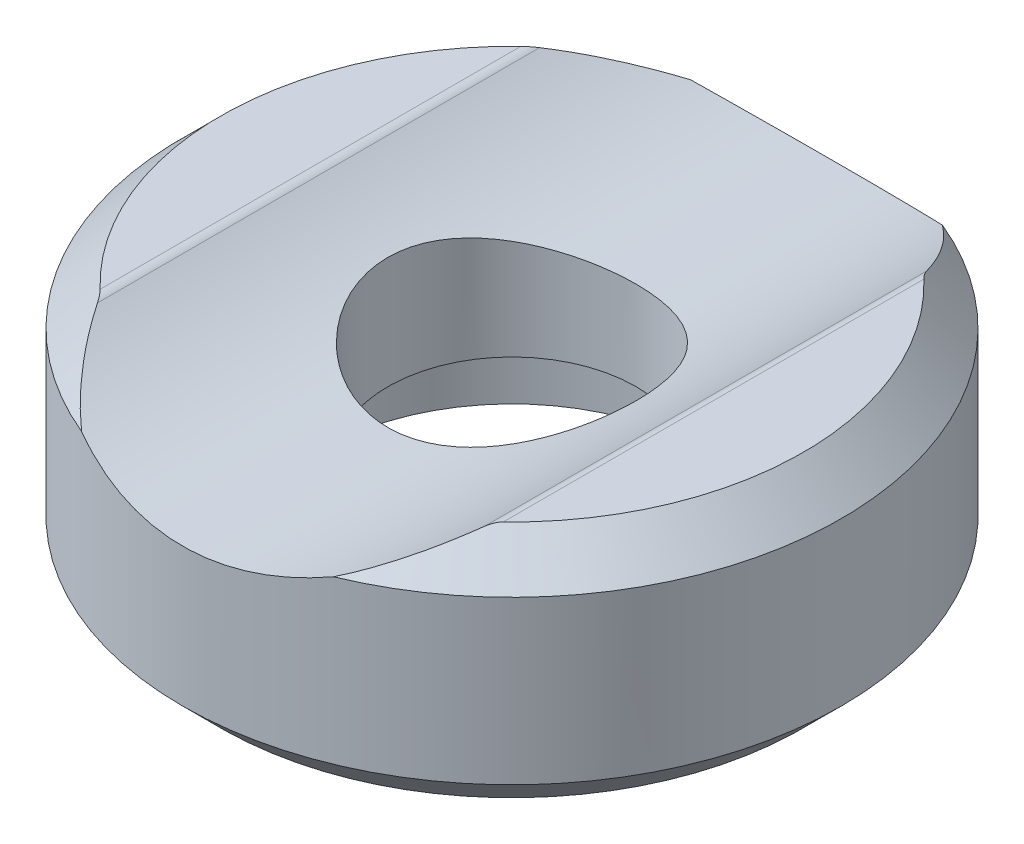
ISO-10303-21;
HEADER;
FILE_DESCRIPTION(('STEP AP214'),'2;1');
FILE_NAME('part.step','',(''),(''),'','','');
FILE_SCHEMA(('AUTOMOTIVE_DESIGN { 1 0 10303 214 1 1 1 1 }'));
ENDSEC;
DATA;
#1=APPLICATION_CONTEXT('core data for automotive mechanical design processes');
#2=APPLICATION_PROTOCOL_DEFINITION('international standard','automotive_design',2000,#1);
#3=PRODUCT_CONTEXT('',#1,'mechanical');
#4=PRODUCT('Part','Part','',(#3));
#5=PRODUCT_RELATED_PRODUCT_CATEGORY('part','',(#4));
#6=PRODUCT_DEFINITION_FORMATION('','',#4);
#7=PRODUCT_DEFINITION_CONTEXT('part definition',#1,'design');
#8=PRODUCT_DEFINITION('design','',#6,#7);
#9=PRODUCT_DEFINITION_SHAPE('','',#8);
#10=(LENGTH_UNIT() NAMED_UNIT(*) SI_UNIT(.MILLI.,.METRE.));
#11=(NAMED_UNIT(*) PLANE_ANGLE_UNIT() SI_UNIT($,.RADIAN.));
#12=(NAMED_UNIT(*) SI_UNIT($,.STERADIAN.) SOLID_ANGLE_UNIT());
#13=UNCERTAINTY_MEASURE_WITH_UNIT(LENGTH_MEASURE(1.E-05),#10,'distance_accuracy_value','');
#14=(GEOMETRIC_REPRESENTATION_CONTEXT(3) GLOBAL_UNCERTAINTY_ASSIGNED_CONTEXT((#13)) GLOBAL_UNIT_ASSIGNED_CONTEXT((#10,
#11,#12)) REPRESENTATION_CONTEXT('',''));
#15=CARTESIAN_POINT('',(0.,0.,0.));
#16=DIRECTION('',(0.,0.,1.));
#17=DIRECTION('',(1.,0.,0.));
#18=AXIS2_PLACEMENT_3D('',#15,#16,#17);
#19=CARTESIAN_POINT('',(0.,0.,0.));
#20=DIRECTION('',(0.,-1.,0.));
#21=DIRECTION('',(0.,0.,-1.));
#22=AXIS2_PLACEMENT_3D('',#19,#20,#21);
#23=CYLINDRICAL_SURFACE('',#22,2.6);
#24=CARTESIAN_POINT('',(-1.83991349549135,3.93905765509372,1.83704064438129));
#25=CARTESIAN_POINT('',(-1.94232335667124,3.96612524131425,1.73447148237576));
#26=CARTESIAN_POINT('',(-2.03611916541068,3.99334161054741,1.62335929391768));
#27=CARTESIAN_POINT('',(-2.20413507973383,4.04510891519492,1.38666461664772));
#28=CARTESIAN_POINT('',(-2.2783605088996,4.06966057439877,1.26108607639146));
#29=CARTESIAN_POINT('',(-2.40521973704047,4.11328848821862,0.998134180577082));
#30=CARTESIAN_POINT('',(-2.45779905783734,4.1323508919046,0.860732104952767));
#31=CARTESIAN_POINT('',(-2.53914294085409,4.16244379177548,0.578215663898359));
#32=CARTESIAN_POINT('',(-2.56791760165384,4.1734776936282,0.433104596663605));
#33=CARTESIAN_POINT('',(-2.59971405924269,4.1857044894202,0.146227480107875));
#34=CARTESIAN_POINT('',(-2.60382389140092,4.18731308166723,0.00459952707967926));
#35=CARTESIAN_POINT('',(-2.58902319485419,4.18159094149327,-0.277251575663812));
#36=CARTESIAN_POINT('',(-2.57011488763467,4.17426107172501,-0.417474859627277));
#37=CARTESIAN_POINT('',(-2.51099174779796,4.15197338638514,-0.688134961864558));
#38=CARTESIAN_POINT('',(-2.47144832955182,4.13725647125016,-0.818740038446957));
#39=CARTESIAN_POINT('',(-2.3728231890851,4.10202697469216,-1.07150689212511));
#40=CARTESIAN_POINT('',(-2.31373706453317,4.08151308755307,-1.19366675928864));
#41=CARTESIAN_POINT('',(-2.17455428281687,4.03582452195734,-1.43221967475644));
#42=CARTESIAN_POINT('',(-2.0936152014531,4.01047868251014,-1.54808790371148));
#43=CARTESIAN_POINT('',(-1.91424028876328,3.95850203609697,-1.76508193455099));
#44=CARTESIAN_POINT('',(-1.8157985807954,3.93187079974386,-1.86620276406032));
#45=CARTESIAN_POINT('',(-1.59812685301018,3.87866377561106,-2.05619005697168));
#46=CARTESIAN_POINT('',(-1.47808355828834,3.85216247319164,-2.14414916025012));
#47=CARTESIAN_POINT('',(-1.22408077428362,3.80364055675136,-2.29863239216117));
#48=CARTESIAN_POINT('',(-1.09012300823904,3.78161938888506,-2.36515917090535));
#49=CARTESIAN_POINT('',(-0.81433205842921,3.74487167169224,-2.47354498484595));
#50=CARTESIAN_POINT('',(-0.672676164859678,3.73002501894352,-2.51581256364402));
#51=CARTESIAN_POINT('',(-0.383657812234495,3.70877173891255,-2.57576465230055));
#52=CARTESIAN_POINT('',(-0.236297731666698,3.70236163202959,-2.59345929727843));
#53=CARTESIAN_POINT('',(0.0513025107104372,3.6988245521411,-2.60325510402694));
#54=CARTESIAN_POINT('',(0.19149263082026,3.70121032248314,-2.59669956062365));
#55=CARTESIAN_POINT('',(0.468630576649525,3.71392828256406,-2.56122999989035));
#56=CARTESIAN_POINT('',(0.605578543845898,3.72426012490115,-2.53231696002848));
#57=CARTESIAN_POINT('',(0.871037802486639,3.75164808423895,-2.45362387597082));
#58=CARTESIAN_POINT('',(0.999621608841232,3.76863366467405,-2.40406238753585));
#59=CARTESIAN_POINT('',(1.24676029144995,3.8076618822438,-2.28568903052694));
#60=CARTESIAN_POINT('',(1.36531289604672,3.82970566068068,-2.21687281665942));
#61=CARTESIAN_POINT('',(1.59506995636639,3.87787923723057,-2.05819147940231));
#62=CARTESIAN_POINT('',(1.70566436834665,3.90415268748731,-1.96748686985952));
#63=CARTESIAN_POINT('',(1.91049037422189,3.95728838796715,-1.76927976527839));
#64=CARTESIAN_POINT('',(2.00471625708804,3.98415084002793,-1.66177143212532));
#65=CARTESIAN_POINT('',(2.17803129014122,4.03671139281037,-1.42767136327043));
#66=CARTESIAN_POINT('',(2.25633653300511,4.06231587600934,-1.30047573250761));
#67=CARTESIAN_POINT('',(2.39031513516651,4.10798756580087,-1.03375396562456));
#68=CARTESIAN_POINT('',(2.44599476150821,4.12805630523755,-0.894231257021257));
#69=CARTESIAN_POINT('',(2.53137521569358,4.15951279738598,-0.611028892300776));
#70=CARTESIAN_POINT('',(2.56179407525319,4.17113921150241,-0.46759334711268));
#71=CARTESIAN_POINT('',(2.59807076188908,4.18505943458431,-0.177228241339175));
#72=CARTESIAN_POINT('',(2.6039395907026,4.18735742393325,-0.0303002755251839));
#73=CARTESIAN_POINT('',(2.59127164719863,4.18246078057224,0.253578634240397));
#74=CARTESIAN_POINT('',(2.57415812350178,4.17581967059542,0.390605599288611));
#75=CARTESIAN_POINT('',(2.51867372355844,4.15484241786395,0.659662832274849));
#76=CARTESIAN_POINT('',(2.48030072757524,4.1405055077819,0.791692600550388));
#77=CARTESIAN_POINT('',(2.38328778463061,4.10569404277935,1.04828236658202));
#78=CARTESIAN_POINT('',(2.32450401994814,4.08517607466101,1.17278179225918));
#79=CARTESIAN_POINT('',(2.18845429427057,4.04027796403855,1.4104733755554));
#80=CARTESIAN_POINT('',(2.111182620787,4.01589662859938,1.52366202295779));
#81=CARTESIAN_POINT('',(1.9347470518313,3.96417279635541,1.742914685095));
#82=CARTESIAN_POINT('',(1.8345270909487,3.93674041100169,1.84810910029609));
#83=CARTESIAN_POINT('',(1.61777388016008,3.8832160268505,2.04054336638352));
#84=CARTESIAN_POINT('',(1.50123736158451,3.85712429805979,2.12777961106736));
#85=CARTESIAN_POINT('',(1.25171964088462,3.80847670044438,2.28370978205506));
#86=CARTESIAN_POINT('',(1.11841861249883,3.78601735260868,2.35192445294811));
#87=CARTESIAN_POINT('',(0.841244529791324,3.74794884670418,2.46468435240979));
#88=CARTESIAN_POINT('',(0.697375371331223,3.73233717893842,2.50923825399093));
#89=CARTESIAN_POINT('',(0.41007324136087,3.71030925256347,2.57147068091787));
#90=CARTESIAN_POINT('',(0.266912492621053,3.70351049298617,2.59026931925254));
#91=CARTESIAN_POINT('',(-0.0206693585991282,3.69859506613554,2.60389705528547));
#92=CARTESIAN_POINT('',(-0.165090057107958,3.70047571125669,2.59873357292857));
#93=CARTESIAN_POINT('',(-0.444741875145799,3.71244194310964,2.56538687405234));
#94=CARTESIAN_POINT('',(-0.580105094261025,3.72218218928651,2.53817234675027));
#95=CARTESIAN_POINT('',(-0.844246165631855,3.74843458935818,2.46294987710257));
#96=CARTESIAN_POINT('',(-0.973021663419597,3.76494914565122,2.41493455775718));
#97=CARTESIAN_POINT('',(-1.23528714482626,3.80537815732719,2.29289144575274));
#98=CARTESIAN_POINT('',(-1.36757220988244,3.82993145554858,2.21648114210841));
#99=CARTESIAN_POINT('',(-1.61635261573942,3.88262049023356,2.04217975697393));
#100=CARTESIAN_POINT('',(-1.73284118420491,3.91075775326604,1.94427950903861));
#101=CARTESIAN_POINT('',(-1.83991349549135,3.93905765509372,1.83704064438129));
#102=B_SPLINE_CURVE_WITH_KNOTS('',3,(#24,#25,#26,#27,#28,#29,#30,#31,#32,#33,#34,#35,#36,#37,
#38,#39,#40,#41,#42,#43,#44,#45,#46,#47,#48,#49,#50,#51,#52,#53,#54,#55,#56,#57,#58,#59,#60,#61,
#62,#63,#64,#65,#66,#67,#68,#69,#70,#71,#72,#73,#74,#75,#76,#77,#78,#79,#80,#81,#82,#83,#84,#85,
#86,#87,#88,#89,#90,#91,#92,#93,#94,#95,#96,#97,#98,#99,#100,#101),.UNSPECIFIED.,.T.,.F.,(4,2,2,
2,2,2,2,2,2,2,2,2,2,2,2,2,2,2,2,2,2,2,2,2,2,2,2,2,2,2,2,2,2,2,2,2,2,2,4),(0.,0.441822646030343,
0.88352498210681,1.32633228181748,1.76895163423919,2.19189324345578,2.61479403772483,
3.02472150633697,3.43474138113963,3.86364760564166,4.29269811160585,4.74399706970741,
5.1952402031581,5.6386424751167,6.08186181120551,6.50090682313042,6.91993351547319,
7.33463333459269,7.74942681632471,8.18377829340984,8.61828101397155,9.07069152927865,
9.52297664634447,9.96191711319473,10.4006608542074,10.8134493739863,11.226279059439,
11.6420787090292,12.0580070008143,12.4995805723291,12.9412427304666,13.393192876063,
13.8449772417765,14.2764126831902,14.7077145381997,15.1210350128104,15.5345021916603,
15.9962425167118,16.4581801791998),.UNSPECIFIED.);
#103=CARTESIAN_POINT('',(-1.83991349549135,3.93905765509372,1.83704064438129));
#104=VERTEX_POINT('',#103);
#105=EDGE_CURVE('E197',#104,#104,#102,.F.);
#106=ORIENTED_EDGE('',*,*,#105,.T.);
#107=EDGE_LOOP('',(#106));
#108=FACE_BOUND('',#107,.T.);
#109=CARTESIAN_POINT('',(0.,1.84120486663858,0.));
#110=DIRECTION('',(0.,-1.,0.));
#111=DIRECTION('',(0.,0.,-1.));
#112=AXIS2_PLACEMENT_3D('',#109,#110,#111);
#113=CIRCLE('',#112,2.6);
#114=CARTESIAN_POINT('',(0.,1.84120486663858,-2.6));
#115=VERTEX_POINT('',#114);
#116=EDGE_CURVE('E129',#115,#115,#113,.T.);
#117=ORIENTED_EDGE('',*,*,#116,.T.);
#118=EDGE_LOOP('',(#117));
#119=FACE_BOUND('',#118,.T.);
#120=ADVANCED_FACE('F14',(#108,#119),#23,.F.);
#121=CARTESIAN_POINT('',(0.,1.00000000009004,0.));
#122=DIRECTION('',(0.,-1.,0.));
#123=DIRECTION('',(0.,0.,-1.));
#124=AXIS2_PLACEMENT_3D('',#121,#122,#123);
#125=CONICAL_SURFACE('',#124,3.99999999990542,1.02974425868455);
#126=ORIENTED_EDGE('',*,*,#116,.F.);
#127=EDGE_LOOP('',(#126));
#128=FACE_BOUND('',#127,.T.);
#129=CARTESIAN_POINT('',(0.,1.,0.));
#130=DIRECTION('',(0.,-1.,0.));
#131=DIRECTION('',(0.,0.,-1.));
#132=AXIS2_PLACEMENT_3D('',#129,#130,#131);
#133=CIRCLE('',#132,4.);
#134=CARTESIAN_POINT('',(0.,1.,-4.));
#135=VERTEX_POINT('',#134);
#136=EDGE_CURVE('E191',#135,#135,#133,.T.);
#137=ORIENTED_EDGE('',*,*,#136,.T.);
#138=EDGE_LOOP('',(#137));
#139=FACE_BOUND('',#138,.T.);
#140=ADVANCED_FACE('F245',(#128,#139),#125,.F.);
#141=CARTESIAN_POINT('',(0.,0.,0.));
#142=DIRECTION('',(0.,-1.,0.));
#143=DIRECTION('',(0.,0.,-1.));
#144=AXIS2_PLACEMENT_3D('',#141,#142,#143);
#145=CYLINDRICAL_SURFACE('',#144,4.);
#146=ORIENTED_EDGE('',*,*,#136,.F.);
#147=EDGE_LOOP('',(#146));
#148=FACE_BOUND('',#147,.T.);
#149=CARTESIAN_POINT('',(0.,0.,0.));
#150=DIRECTION('',(0.,-1.,0.));
#151=DIRECTION('',(0.,0.,-1.));
#152=AXIS2_PLACEMENT_3D('',#149,#150,#151);
#153=CIRCLE('',#152,4.);
#154=CARTESIAN_POINT('',(0.,0.,-4.));
#155=VERTEX_POINT('',#154);
#156=EDGE_CURVE('E83',#155,#155,#153,.F.);
#157=ORIENTED_EDGE('',*,*,#156,.F.);
#158=EDGE_LOOP('',(#157));
#159=FACE_BOUND('',#158,.T.);
#160=ADVANCED_FACE('F243',(#148,#159),#145,.F.);
#161=CARTESIAN_POINT('',(6.1,5.,0.));
#162=DIRECTION('',(0.,1.,0.));
#163=DIRECTION('',(0.,0.,1.));
#164=AXIS2_PLACEMENT_3D('',#161,#162,#163);
#165=PLANE('',#164);
#166=CARTESIAN_POINT('',(0.,4.99999999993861,0.));
#167=DIRECTION('',(0.,-1.,0.));
#168=DIRECTION('',(0.,0.,-1.));
#169=AXIS2_PLACEMENT_3D('',#166,#167,#168);
#170=CIRCLE('',#169,6.10000000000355);
#171=CARTESIAN_POINT('',(4.22018956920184,4.99999999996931,-4.40454310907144));
#172=VERTEX_POINT('',#171);
#173=CARTESIAN_POINT('',(4.22018956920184,4.99999999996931,4.40454310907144));
#174=VERTEX_POINT('',#173);
#175=EDGE_CURVE('E160',#172,#174,#170,.T.);
#176=ORIENTED_EDGE('',*,*,#175,.F.);
#177=DIRECTION('',(0.,0.,-1.));
#178=VECTOR('',#177,1.);
#179=CARTESIAN_POINT('',(4.22018956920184,5.,7.9));
#180=LINE('',#179,#178);
#181=EDGE_CURVE('E78',#174,#172,#180,.T.);
#182=ORIENTED_EDGE('',*,*,#181,.F.);
#183=EDGE_LOOP('',(#176,#182));
#184=FACE_BOUND('',#183,.T.);
#185=ADVANCED_FACE('F140',(#184),#165,.T.);
#186=CARTESIAN_POINT('',(4.22018956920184,4.7,7.9));
#187=DIRECTION('',(0.,0.,-1.));
#188=DIRECTION('',(-1.,0.,0.));
#189=AXIS2_PLACEMENT_3D('',#186,#187,#188);
#190=CYLINDRICAL_SURFACE('',#189,0.299999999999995);
#191=CARTESIAN_POINT('',(4.05138198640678,4.94799999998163,-4.62962287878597));
#192=CARTESIAN_POINT('',(4.06015765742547,4.95396523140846,-4.61401675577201));
#193=CARTESIAN_POINT('',(4.06933969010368,4.95954155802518,-4.59847896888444));
#194=CARTESIAN_POINT('',(4.08858821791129,4.96981778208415,-4.56759076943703));
#195=CARTESIAN_POINT('',(4.0986574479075,4.97451481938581,-4.55224111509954));
#196=CARTESIAN_POINT('',(4.11948376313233,4.9828094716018,-4.5221879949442));
#197=CARTESIAN_POINT('',(4.13022281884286,4.98642740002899,-4.50747773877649));
#198=CARTESIAN_POINT('',(4.15261675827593,4.99252103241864,-4.47854863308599));
#199=CARTESIAN_POINT('',(4.16427023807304,4.99499844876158,-4.46432907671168));
#200=CARTESIAN_POINT('',(4.18335840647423,4.99781289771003,-4.44255663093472));
#201=CARTESIAN_POINT('',(4.19045340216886,4.99861221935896,-4.4347653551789));
#202=CARTESIAN_POINT('',(4.2050321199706,4.99970589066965,-4.41943499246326));
#203=CARTESIAN_POINT('',(4.21251781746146,4.99999735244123,-4.41189758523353));
#204=CARTESIAN_POINT('',(4.22018956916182,5.,-4.40454310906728));
#205=B_SPLINE_CURVE_WITH_KNOTS('',3,(#191,#192,#193,#194,#195,#196,#197,#198,#199,#200,#201,
#202,#203,#204),.UNSPECIFIED.,.F.,.F.,(4,2,2,2,2,2,4),(0.,0.0566215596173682,0.113424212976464,
0.169078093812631,0.224648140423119,0.256332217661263,0.288195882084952),.UNSPECIFIED.);
#206=CARTESIAN_POINT('',(4.0513819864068,4.94799999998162,-4.62962287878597));
#207=VERTEX_POINT('',#206);
#208=EDGE_CURVE('E153',#207,#172,#205,.T.);
#209=ORIENTED_EDGE('',*,*,#208,.F.);
#210=DIRECTION('',(0.,0.,-1.));
#211=VECTOR('',#210,1.);
#212=CARTESIAN_POINT('',(4.05138198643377,4.948,7.9));
#213=LINE('',#212,#211);
#214=CARTESIAN_POINT('',(4.05138198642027,4.94799999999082,4.62962287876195));
#215=VERTEX_POINT('',#214);
#216=EDGE_CURVE('E182',#207,#215,#213,.F.);
#217=ORIENTED_EDGE('',*,*,#216,.T.);
#218=CARTESIAN_POINT('',(4.22018956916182,5.,4.40454310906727));
#219=CARTESIAN_POINT('',(4.20860645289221,4.99998761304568,4.41565915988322));
#220=CARTESIAN_POINT('',(4.19744912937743,4.99933022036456,4.42717153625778));
#221=CARTESIAN_POINT('',(4.17593674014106,4.99691796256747,4.45077684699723));
#222=CARTESIAN_POINT('',(4.16558010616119,4.99516530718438,4.46286856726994));
#223=CARTESIAN_POINT('',(4.1358394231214,4.98860685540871,4.4994352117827));
#224=CARTESIAN_POINT('',(4.11747800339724,4.9824896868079,4.52451003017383));
#225=CARTESIAN_POINT('',(4.09159014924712,4.97120655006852,4.56302892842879));
#226=CARTESIAN_POINT('',(4.08314651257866,4.96703146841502,4.5761817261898));
#227=CARTESIAN_POINT('',(4.06682624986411,4.95800580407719,4.60274271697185));
#228=CARTESIAN_POINT('',(4.05895391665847,4.95315077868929,4.61615204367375));
#229=CARTESIAN_POINT('',(4.05138198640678,4.94799999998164,4.62962287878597));
#230=B_SPLINE_CURVE_WITH_KNOTS('',3,(#218,#219,#220,#221,#222,#223,#224,#225,#226,#227,#228,
#229),.UNSPECIFIED.,.F.,.F.,(4,2,2,2,2,4),(0.,0.0480894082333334,0.0960821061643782,
0.190777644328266,0.239293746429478,0.288143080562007),.UNSPECIFIED.);
#231=EDGE_CURVE('E145',#174,#215,#230,.T.);
#232=ORIENTED_EDGE('',*,*,#231,.F.);
#233=ORIENTED_EDGE('',*,*,#181,.T.);
#234=EDGE_LOOP('',(#209,#217,#232,#233));
#235=FACE_BOUND('',#234,.T.);
#236=ADVANCED_FACE('F134',(#235),#190,.T.);
#237=CARTESIAN_POINT('',(-4.22018956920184,4.7,7.9));
#238=DIRECTION('',(0.,0.,-1.));
#239=DIRECTION('',(-1.,0.,0.));
#240=AXIS2_PLACEMENT_3D('',#237,#238,#239);
#241=CYLINDRICAL_SURFACE('',#240,0.300000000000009);
#242=CARTESIAN_POINT('',(-4.22018956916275,5.00000000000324,4.40454310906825));
#243=CARTESIAN_POINT('',(-4.20860645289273,4.99998761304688,4.4156591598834));
#244=CARTESIAN_POINT('',(-4.19744912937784,4.99933022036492,4.42717153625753));
#245=CARTESIAN_POINT('',(-4.17593674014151,4.99691796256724,4.45077684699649));
#246=CARTESIAN_POINT('',(-4.1655801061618,4.99516530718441,4.46286856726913));
#247=CARTESIAN_POINT('',(-4.13583942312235,4.98860685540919,4.4994352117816));
#248=CARTESIAN_POINT('',(-4.11747800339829,4.9824896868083,4.52451003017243));
#249=CARTESIAN_POINT('',(-4.09159014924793,4.97120655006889,4.56302892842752));
#250=CARTESIAN_POINT('',(-4.08314651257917,4.9670314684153,4.57618172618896));
#251=CARTESIAN_POINT('',(-4.06682624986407,4.95800580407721,4.60274271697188));
#252=CARTESIAN_POINT('',(-4.05895391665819,4.95315077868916,4.61615204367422));
#253=CARTESIAN_POINT('',(-4.05138198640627,4.94799999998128,4.62962287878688));
#254=B_SPLINE_CURVE_WITH_KNOTS('',3,(#242,#243,#244,#245,#246,#247,#248,#249,#250,#251,#252,
#253),.UNSPECIFIED.,.F.,.F.,(4,2,2,2,2,4),(0.,0.0480894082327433,0.0960821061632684,
0.190777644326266,0.239293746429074,0.288143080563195),.UNSPECIFIED.);
#255=CARTESIAN_POINT('',(-4.22018956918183,4.9999999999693,4.40454310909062));
#256=VERTEX_POINT('',#255);
#257=CARTESIAN_POINT('',(-4.05138198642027,4.94799999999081,4.62962287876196));
#258=VERTEX_POINT('',#257);
#259=EDGE_CURVE('E77',#256,#258,#254,.T.);
#260=ORIENTED_EDGE('',*,*,#259,.T.);
#261=DIRECTION('',(0.,0.,-1.));
#262=VECTOR('',#261,1.);
#263=CARTESIAN_POINT('',(-4.05138198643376,4.948,7.9));
#264=LINE('',#263,#262);
#265=CARTESIAN_POINT('',(-4.05138198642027,4.94799999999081,-4.62962287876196));
#266=VERTEX_POINT('',#265);
#267=EDGE_CURVE('E75',#258,#266,#264,.T.);
#268=ORIENTED_EDGE('',*,*,#267,.T.);
#269=CARTESIAN_POINT('',(-4.05138198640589,4.9479999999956,-4.62962287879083));
#270=CARTESIAN_POINT('',(-4.06015765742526,4.95396523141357,-4.61401675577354));
#271=CARTESIAN_POINT('',(-4.0693396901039,4.95954155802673,-4.59847896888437));
#272=CARTESIAN_POINT('',(-4.08858821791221,4.96981778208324,-4.56759076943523));
#273=CARTESIAN_POINT('',(-4.09865744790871,4.97451481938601,-4.5522411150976));
#274=CARTESIAN_POINT('',(-4.11948376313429,4.98280947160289,-4.52218799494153));
#275=CARTESIAN_POINT('',(-4.13022281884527,4.98642740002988,-4.50747773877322));
#276=CARTESIAN_POINT('',(-4.15261675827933,4.99252103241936,-4.47854863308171));
#277=CARTESIAN_POINT('',(-4.16427023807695,4.99499844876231,-4.464329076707));
#278=CARTESIAN_POINT('',(-4.18335840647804,4.9978128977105,-4.44255663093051));
#279=CARTESIAN_POINT('',(-4.19045340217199,4.99861221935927,-4.43476535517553));
#280=CARTESIAN_POINT('',(-4.2050321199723,4.99970589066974,-4.41943499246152));
#281=CARTESIAN_POINT('',(-4.2125178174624,4.99999735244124,-4.41189758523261));
#282=CARTESIAN_POINT('',(-4.22018956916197,5.,-4.40454310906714));
#283=B_SPLINE_CURVE_WITH_KNOTS('',3,(#269,#270,#271,#272,#273,#274,#275,#276,#277,#278,#279,
#280,#281,#282),.UNSPECIFIED.,.F.,.F.,(4,2,2,2,2,2,4),(0.,0.0566215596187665,0.113424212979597,
0.169078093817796,0.224648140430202,0.256332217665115,0.288195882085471),.UNSPECIFIED.);
#284=CARTESIAN_POINT('',(-4.22018956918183,4.9999999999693,-4.40454310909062));
#285=VERTEX_POINT('',#284);
#286=EDGE_CURVE('E67',#266,#285,#283,.T.);
#287=ORIENTED_EDGE('',*,*,#286,.T.);
#288=DIRECTION('',(0.,0.,1.));
#289=VECTOR('',#288,1.);
#290=CARTESIAN_POINT('',(-4.22018956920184,5.,0.));
#291=LINE('',#290,#289);
#292=EDGE_CURVE('E73',#256,#285,#291,.F.);
#293=ORIENTED_EDGE('',*,*,#292,.F.);
#294=EDGE_LOOP('',(#260,#268,#287,#293));
#295=FACE_BOUND('',#294,.T.);
#296=ADVANCED_FACE('F72',(#295),#241,.T.);
#297=CARTESIAN_POINT('',(6.1,5.,0.));
#298=DIRECTION('',(0.,1.,0.));
#299=DIRECTION('',(0.,0.,1.));
#300=AXIS2_PLACEMENT_3D('',#297,#298,#299);
#301=PLANE('',#300);
#302=ORIENTED_EDGE('',*,*,#292,.T.);
#303=CARTESIAN_POINT('',(0.,4.99999999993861,0.));
#304=DIRECTION('',(0.,-1.,0.));
#305=DIRECTION('',(0.,0.,-1.));
#306=AXIS2_PLACEMENT_3D('',#303,#304,#305);
#307=CIRCLE('',#306,6.10000000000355);
#308=EDGE_CURVE('E82',#256,#285,#307,.T.);
#309=ORIENTED_EDGE('',*,*,#308,.F.);
#310=EDGE_LOOP('',(#302,#309));
#311=FACE_BOUND('',#310,.T.);
#312=ADVANCED_FACE('F81',(#311),#301,.T.);
#313=CARTESIAN_POINT('',(4.,0.,0.));
#314=DIRECTION('',(0.,-1.,0.));
#315=DIRECTION('',(0.,0.,-1.));
#316=AXIS2_PLACEMENT_3D('',#313,#314,#315);
#317=PLANE('',#316);
#318=ORIENTED_EDGE('',*,*,#156,.T.);
#319=EDGE_LOOP('',(#318));
#320=FACE_BOUND('',#319,.T.);
#321=CARTESIAN_POINT('',(0.,0.,0.));
#322=DIRECTION('',(0.,1.,0.));
#323=DIRECTION('',(-1.,0.,0.));
#324=AXIS2_PLACEMENT_3D('',#321,#322,#323);
#325=CIRCLE('',#324,6.10000000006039);
#326=CARTESIAN_POINT('',(-6.10000000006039,0.,0.));
#327=VERTEX_POINT('',#326);
#328=EDGE_CURVE('E86',#327,#327,#325,.T.);
#329=ORIENTED_EDGE('',*,*,#328,.F.);
#330=EDGE_LOOP('',(#329));
#331=FACE_BOUND('',#330,.T.);
#332=ADVANCED_FACE('F164',(#320,#331),#317,.T.);
#333=CARTESIAN_POINT('',(0.,4.19999999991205,0.));
#334=DIRECTION('',(0.,-1.,0.));
#335=DIRECTION('',(0.,0.,-1.));
#336=AXIS2_PLACEMENT_3D('',#333,#334,#335);
#337=CONICAL_SURFACE('',#336,6.90000000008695,0.785398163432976);
#338=ORIENTED_EDGE('',*,*,#231,.T.);
#339=CARTESIAN_POINT('',(4.05138198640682,4.9479999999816,4.62962287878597));
#340=CARTESIAN_POINT('',(3.95882027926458,4.88502688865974,4.79424639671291));
#341=CARTESIAN_POINT('',(3.86027360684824,4.82107653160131,4.95524490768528));
#342=CARTESIAN_POINT('',(3.65123639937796,4.69327261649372,5.26742374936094));
#343=CARTESIAN_POINT('',(3.54083770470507,4.62942172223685,5.41866683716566));
#344=CARTESIAN_POINT('',(3.306814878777,4.50291653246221,5.7111776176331));
#345=CARTESIAN_POINT('',(3.18319243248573,4.44026208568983,5.85244657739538));
#346=CARTESIAN_POINT('',(2.92102872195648,4.3175569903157,6.1238095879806));
#347=CARTESIAN_POINT('',(2.78238499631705,4.25752872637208,6.25381439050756));
#348=CARTESIAN_POINT('',(2.63628526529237,4.19999999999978,6.37651942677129));
#349=B_SPLINE_CURVE_WITH_KNOTS('',3,(#339,#340,#341,#342,#343,#344,#345,#346,#347,#348),
.UNSPECIFIED.,.F.,.F.,(4,2,2,2,4),(0.,0.597258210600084,1.19018328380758,1.78303289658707,
2.38021672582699),.UNSPECIFIED.);
#350=CARTESIAN_POINT('',(2.63628526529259,4.19999999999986,6.37651942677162));
#351=VERTEX_POINT('',#350);
#352=EDGE_CURVE('E177',#215,#351,#349,.T.);
#353=ORIENTED_EDGE('',*,*,#352,.T.);
#354=CARTESIAN_POINT('',(0.,4.20000000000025,0.));
#355=DIRECTION('',(0.,-1.,0.));
#356=DIRECTION('',(0.,0.,-1.));
#357=AXIS2_PLACEMENT_3D('',#354,#355,#356);
#358=CIRCLE('',#357,6.9);
#359=CARTESIAN_POINT('',(2.63628526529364,4.20000000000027,-6.3765194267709));
#360=VERTEX_POINT('',#359);
#361=EDGE_CURVE('E195',#360,#351,#358,.T.);
#362=ORIENTED_EDGE('',*,*,#361,.F.);
#363=CARTESIAN_POINT('',(2.63628526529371,4.2000000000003,-6.37651942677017));
#364=CARTESIAN_POINT('',(2.76277390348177,4.2497947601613,-6.27031203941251));
#365=CARTESIAN_POINT('',(2.8836855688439,4.30148251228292,-6.15858946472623));
#366=CARTESIAN_POINT('',(3.11470853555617,4.40732701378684,-5.92575943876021));
#367=CARTESIAN_POINT('',(3.22482995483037,4.46148137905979,-5.80466097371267));
#368=CARTESIAN_POINT('',(3.4336941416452,4.57043109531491,-5.555910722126));
#369=CARTESIAN_POINT('',(3.53254998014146,4.6252125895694,-5.42834694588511));
#370=CARTESIAN_POINT('',(3.72076681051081,4.73495640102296,-5.16649405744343));
#371=CARTESIAN_POINT('',(3.81012889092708,4.7899186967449,-5.03220571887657));
#372=CARTESIAN_POINT('',(3.92190413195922,4.86181371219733,-4.85138762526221));
#373=CARTESIAN_POINT('',(3.94840233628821,4.8791118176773,-4.80748404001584));
#374=CARTESIAN_POINT('',(4.00054372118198,4.91362968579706,-4.71902214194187));
#375=CARTESIAN_POINT('',(4.02618526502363,4.9308492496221,-4.67446278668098));
#376=CARTESIAN_POINT('',(4.05138198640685,4.9479999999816,-4.629622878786));
#377=B_SPLINE_CURVE_WITH_KNOTS('',3,(#363,#364,#365,#366,#367,#368,#369,#370,#371,#372,#373,
#374,#375,#376),.UNSPECIFIED.,.F.,.F.,(4,2,2,2,2,2,4),(0.,0.51712347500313,1.03375731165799,
1.54463707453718,2.05545819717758,2.21780941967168,2.3804548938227),.UNSPECIFIED.);
#378=EDGE_CURVE('E170',#360,#207,#377,.T.);
#379=ORIENTED_EDGE('',*,*,#378,.T.);
#380=ORIENTED_EDGE('',*,*,#208,.T.);
#381=ORIENTED_EDGE('',*,*,#175,.T.);
#382=EDGE_LOOP('',(#338,#353,#362,#379,#380,#381));
#383=FACE_BOUND('',#382,.T.);
#384=ADVANCED_FACE('F161',(#383),#337,.T.);
#385=CARTESIAN_POINT('',(0.,10.9,7.9));
#386=DIRECTION('',(0.,0.,-1.));
#387=DIRECTION('',(-1.,0.,0.));
#388=AXIS2_PLACEMENT_3D('',#385,#386,#387);
#389=CYLINDRICAL_SURFACE('',#388,7.2);
#390=ORIENTED_EDGE('',*,*,#105,.F.);
#391=EDGE_LOOP('',(#390));
#392=FACE_BOUND('',#391,.T.);
#393=CARTESIAN_POINT('',(-2.63628526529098,4.19999999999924,-6.37651942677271));
#394=CARTESIAN_POINT('',(-2.50820689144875,4.14958822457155,-6.42948722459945));
#395=CARTESIAN_POINT('',(-2.37740258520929,4.10237738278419,-6.47903220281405));
#396=CARTESIAN_POINT('',(-2.11084430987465,4.01494598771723,-6.57070494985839));
#397=CARTESIAN_POINT('',(-1.97508696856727,3.97473030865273,-6.61282754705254));
#398=CARTESIAN_POINT('',(-1.69909936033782,3.90189528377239,-6.68906535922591));
#399=CARTESIAN_POINT('',(-1.558862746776,3.86928731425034,-6.72316858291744));
#400=CARTESIAN_POINT('',(-1.27495082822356,3.81230269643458,-6.78273755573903));
#401=CARTESIAN_POINT('',(-1.13127634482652,3.78792410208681,-6.80820534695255));
#402=CARTESIAN_POINT('',(-0.840779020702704,3.74774983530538,-6.85016197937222));
#403=CARTESIAN_POINT('',(-0.693945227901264,3.73199184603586,-6.86661139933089));
#404=CARTESIAN_POINT('',(-0.398836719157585,3.70953234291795,-6.89005344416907));
#405=CARTESIAN_POINT('',(-0.250562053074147,3.70283051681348,-6.89704639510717));
#406=CARTESIAN_POINT('',(0.046072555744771,3.69862149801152,-6.90143845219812));
#407=CARTESIAN_POINT('',(0.194432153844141,3.70110269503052,-6.898849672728));
#408=CARTESIAN_POINT('',(0.490231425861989,3.71518304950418,-6.8841556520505));
#409=CARTESIAN_POINT('',(0.637671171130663,3.72678149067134,-6.87205115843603));
#410=CARTESIAN_POINT('',(0.923296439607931,3.7580715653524,-6.83938319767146));
#411=CARTESIAN_POINT('',(1.061580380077,3.77733695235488,-6.8192651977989));
#412=CARTESIAN_POINT('',(1.33547991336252,3.82357497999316,-6.77095562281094));
#413=CARTESIAN_POINT('',(1.47109432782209,3.85055094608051,-6.74276056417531));
#414=CARTESIAN_POINT('',(1.73871172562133,3.91174464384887,-6.67875742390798));
#415=CARTESIAN_POINT('',(1.87071748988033,3.94595661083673,-6.64295540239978));
#416=CARTESIAN_POINT('',(2.13060559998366,4.02113286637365,-6.5642174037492));
#417=CARTESIAN_POINT('',(2.25848834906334,4.06209649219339,-6.52128212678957));
#418=CARTESIAN_POINT('',(2.42665058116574,4.12110557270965,-6.45936777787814));
#419=CARTESIAN_POINT('',(2.4689987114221,4.13641646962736,-6.44329785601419));
#420=CARTESIAN_POINT('',(2.55308447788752,4.16770710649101,-6.41044402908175));
#421=CARTESIAN_POINT('',(2.5948229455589,4.18368579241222,-6.39366124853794));
#422=CARTESIAN_POINT('',(2.6362852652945,4.20000000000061,-6.37651942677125));
#423=B_SPLINE_CURVE_WITH_KNOTS('',3,(#393,#394,#395,#396,#397,#398,#399,#400,#401,#402,#403,
#404,#405,#406,#407,#408,#409,#410,#411,#412,#413,#414,#415,#416,#417,#418,#419,#420,#421,#422),
.UNSPECIFIED.,.F.,.F.,(4,2,2,2,2,2,2,2,2,2,2,2,2,2,4),(0.,0.442413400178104,0.885133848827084,
1.32851214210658,1.77178551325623,2.2169813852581,2.66216190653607,3.10677976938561,
3.55136270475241,3.97407284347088,4.3969655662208,4.81952264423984,5.2420382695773,
5.38546596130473,5.5286752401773),.UNSPECIFIED.);
#424=CARTESIAN_POINT('',(-2.63628526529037,4.19999999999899,-6.37651942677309));
#425=VERTEX_POINT('',#424);
#426=EDGE_CURVE('E89',#425,#360,#423,.T.);
#427=ORIENTED_EDGE('',*,*,#426,.F.);
#428=CARTESIAN_POINT('',(-4.0513819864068,4.9479999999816,-4.62962287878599));
#429=CARTESIAN_POINT('',(-3.95882027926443,4.88502688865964,-4.79424639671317));
#430=CARTESIAN_POINT('',(-3.86027360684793,4.82107653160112,-4.95524490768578));
#431=CARTESIAN_POINT('',(-3.6512363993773,4.69327261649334,-5.26742374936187));
#432=CARTESIAN_POINT('',(-3.54083770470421,4.62942172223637,-5.4186668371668));
#433=CARTESIAN_POINT('',(-3.30681487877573,4.50291653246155,-5.7111776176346));
#434=CARTESIAN_POINT('',(-3.18319243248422,4.44026208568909,-5.85244657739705));
#435=CARTESIAN_POINT('',(-2.92102872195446,4.3175569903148,-6.12380958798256));
#436=CARTESIAN_POINT('',(-2.78238499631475,4.25752872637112,-6.25381439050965));
#437=CARTESIAN_POINT('',(-2.63628526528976,4.19999999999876,-6.37651942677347));
#438=B_SPLINE_CURVE_WITH_KNOTS('',3,(#428,#429,#430,#431,#432,#433,#434,#435,#436,#437),
.UNSPECIFIED.,.F.,.F.,(4,2,2,2,4),(0.,0.597258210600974,1.19018328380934,1.78303289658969,
2.38021672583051),.UNSPECIFIED.);
#439=EDGE_CURVE('E91',#266,#425,#438,.T.);
#440=ORIENTED_EDGE('',*,*,#439,.F.);
#441=ORIENTED_EDGE('',*,*,#267,.F.);
#442=CARTESIAN_POINT('',(-2.63628526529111,4.19999999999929,6.37651942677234));
#443=CARTESIAN_POINT('',(-2.76277390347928,4.24979476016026,6.27031203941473));
#444=CARTESIAN_POINT('',(-2.8836855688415,4.30148251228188,6.15858946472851));
#445=CARTESIAN_POINT('',(-3.11470853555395,4.40732701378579,5.92575943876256));
#446=CARTESIAN_POINT('',(-3.22482995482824,4.46148137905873,5.80466097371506));
#447=CARTESIAN_POINT('',(-3.43369414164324,4.57043109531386,5.55591072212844));
#448=CARTESIAN_POINT('',(-3.53254998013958,4.62521258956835,5.42834694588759));
#449=CARTESIAN_POINT('',(-3.72076681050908,4.73495640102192,5.16649405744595));
#450=CARTESIAN_POINT('',(-3.81012889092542,4.78991869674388,5.03220571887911));
#451=CARTESIAN_POINT('',(-3.92190413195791,4.8618137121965,4.85138762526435));
#452=CARTESIAN_POINT('',(-3.94840233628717,4.87911181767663,4.80748404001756));
#453=CARTESIAN_POINT('',(-4.00054372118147,4.91362968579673,4.71902214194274));
#454=CARTESIAN_POINT('',(-4.02618526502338,4.93084924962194,4.67446278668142));
#455=CARTESIAN_POINT('',(-4.05138198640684,4.9479999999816,4.629622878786));
#456=B_SPLINE_CURVE_WITH_KNOTS('',3,(#442,#443,#444,#445,#446,#447,#448,#449,#450,#451,#452,
#453,#454,#455),.UNSPECIFIED.,.F.,.F.,(4,2,2,2,2,2,4),(0.,0.517123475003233,1.03375731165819,
1.54463707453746,2.05545819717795,2.21780941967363,2.38045489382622),.UNSPECIFIED.);
#457=CARTESIAN_POINT('',(-2.63628526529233,4.19999999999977,6.37651942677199));
#458=VERTEX_POINT('',#457);
#459=EDGE_CURVE('E33',#458,#258,#456,.T.);
#460=ORIENTED_EDGE('',*,*,#459,.F.);
#461=CARTESIAN_POINT('',(2.63628526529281,4.19999999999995,6.37651942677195));
#462=CARTESIAN_POINT('',(2.50820689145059,4.14958822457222,6.42948722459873));
#463=CARTESIAN_POINT('',(2.37740258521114,4.10237738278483,6.47903220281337));
#464=CARTESIAN_POINT('',(2.11084430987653,4.0149459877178,6.57070494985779));
#465=CARTESIAN_POINT('',(1.97508696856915,3.97473030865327,6.61282754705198));
#466=CARTESIAN_POINT('',(1.69909936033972,3.90189528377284,6.68906535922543));
#467=CARTESIAN_POINT('',(1.55886274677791,3.86928731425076,6.72316858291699));
#468=CARTESIAN_POINT('',(1.27495082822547,3.81230269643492,6.78273755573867));
#469=CARTESIAN_POINT('',(1.13127634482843,3.78792410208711,6.80820534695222));
#470=CARTESIAN_POINT('',(0.840779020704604,3.7477498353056,6.85016197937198));
#471=CARTESIAN_POINT('',(0.693945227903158,3.73199184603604,6.8666113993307));
#472=CARTESIAN_POINT('',(0.398836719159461,3.70953234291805,6.89005344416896));
#473=CARTESIAN_POINT('',(0.250562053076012,3.70283051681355,6.8970463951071));
#474=CARTESIAN_POINT('',(-0.0460725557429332,3.69862149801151,6.90143845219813));
#475=CARTESIAN_POINT('',(-0.194432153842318,3.70110269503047,6.89884967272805));
#476=CARTESIAN_POINT('',(-0.490231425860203,3.71518304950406,6.88415565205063));
#477=CARTESIAN_POINT('',(-0.637671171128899,3.72678149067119,6.8720511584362));
#478=CARTESIAN_POINT('',(-0.923296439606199,3.75807156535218,6.83938319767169));
#479=CARTESIAN_POINT('',(-1.06158038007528,3.77733695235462,6.81926519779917));
#480=CARTESIAN_POINT('',(-1.33547991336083,3.82357497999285,6.77095562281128));
#481=CARTESIAN_POINT('',(-1.47109432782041,3.85055094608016,6.74276056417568));
#482=CARTESIAN_POINT('',(-1.73871172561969,3.91174464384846,6.6787574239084));
#483=CARTESIAN_POINT('',(-1.8707174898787,3.9459566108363,6.64295540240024));
#484=CARTESIAN_POINT('',(-2.13060559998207,4.02113286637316,6.56421740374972));
#485=CARTESIAN_POINT('',(-2.25848834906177,4.06209649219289,6.52128212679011));
#486=CARTESIAN_POINT('',(-2.42665058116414,4.12110557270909,6.45936777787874));
#487=CARTESIAN_POINT('',(-2.46899871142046,4.13641646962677,6.44329785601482));
#488=CARTESIAN_POINT('',(-2.55308447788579,4.16770710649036,6.41044402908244));
#489=CARTESIAN_POINT('',(-2.59482294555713,4.18368579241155,6.39366124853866));
#490=CARTESIAN_POINT('',(-2.63628526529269,4.19999999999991,6.376519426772));
#491=B_SPLINE_CURVE_WITH_KNOTS('',3,(#461,#462,#463,#464,#465,#466,#467,#468,#469,#470,#471,
#472,#473,#474,#475,#476,#477,#478,#479,#480,#481,#482,#483,#484,#485,#486,#487,#488,#489,#490),
.UNSPECIFIED.,.F.,.F.,(4,2,2,2,2,2,2,2,2,2,2,2,2,2,4),(0.,0.442413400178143,0.885133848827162,
1.3285121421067,1.77178551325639,2.2169813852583,2.66216190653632,3.10677976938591,
3.55136270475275,3.97407284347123,4.39696556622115,4.81952264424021,5.24203826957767,
5.38546596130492,5.52867524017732),.UNSPECIFIED.);
#492=EDGE_CURVE('E199',#351,#458,#491,.T.);
#493=ORIENTED_EDGE('',*,*,#492,.F.);
#494=ORIENTED_EDGE('',*,*,#352,.F.);
#495=ORIENTED_EDGE('',*,*,#216,.F.);
#496=ORIENTED_EDGE('',*,*,#378,.F.);
#497=EDGE_LOOP('',(#427,#440,#441,#460,#493,#494,#495,#496));
#498=FACE_BOUND('',#497,.T.);
#499=ADVANCED_FACE('F107',(#392,#498),#389,.F.);
#500=CARTESIAN_POINT('',(0.,4.19999999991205,0.));
#501=DIRECTION('',(0.,-1.,0.));
#502=DIRECTION('',(0.,0.,-1.));
#503=AXIS2_PLACEMENT_3D('',#500,#501,#502);
#504=CONICAL_SURFACE('',#503,6.90000000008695,0.785398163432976);
#505=ORIENTED_EDGE('',*,*,#259,.F.);
#506=ORIENTED_EDGE('',*,*,#308,.T.);
#507=ORIENTED_EDGE('',*,*,#286,.F.);
#508=ORIENTED_EDGE('',*,*,#439,.T.);
#509=CARTESIAN_POINT('',(0.,4.20000000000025,0.));
#510=DIRECTION('',(0.,-1.,0.));
#511=DIRECTION('',(0.,0.,-1.));
#512=AXIS2_PLACEMENT_3D('',#509,#510,#511);
#513=CIRCLE('',#512,6.9);
#514=EDGE_CURVE('E24',#458,#425,#513,.T.);
#515=ORIENTED_EDGE('',*,*,#514,.F.);
#516=ORIENTED_EDGE('',*,*,#459,.T.);
#517=EDGE_LOOP('',(#505,#506,#507,#508,#515,#516));
#518=FACE_BOUND('',#517,.T.);
#519=ADVANCED_FACE('F85',(#518),#504,.T.);
#520=CARTESIAN_POINT('',(0.,0.799999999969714,0.));
#521=DIRECTION('',(0.,1.,0.));
#522=DIRECTION('',(-1.,0.,0.));
#523=AXIS2_PLACEMENT_3D('',#520,#521,#522);
#524=CONICAL_SURFACE('',#523,6.9000000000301,0.785398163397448);
#525=ORIENTED_EDGE('',*,*,#328,.T.);
#526=EDGE_LOOP('',(#525));
#527=FACE_BOUND('',#526,.T.);
#528=CARTESIAN_POINT('',(0.,0.8,0.));
#529=DIRECTION('',(0.,-1.,0.));
#530=DIRECTION('',(0.,0.,-1.));
#531=AXIS2_PLACEMENT_3D('',#528,#529,#530);
#532=CIRCLE('',#531,6.9);
#533=CARTESIAN_POINT('',(0.,0.8,-6.9));
#534=VERTEX_POINT('',#533);
#535=EDGE_CURVE('E9',#534,#534,#532,.F.);
#536=ORIENTED_EDGE('',*,*,#535,.F.);
#537=EDGE_LOOP('',(#536));
#538=FACE_BOUND('',#537,.T.);
#539=ADVANCED_FACE('F113',(#527,#538),#524,.T.);
#540=CARTESIAN_POINT('',(0.,0.,0.));
#541=DIRECTION('',(0.,-1.,0.));
#542=DIRECTION('',(0.,0.,-1.));
#543=AXIS2_PLACEMENT_3D('',#540,#541,#542);
#544=CYLINDRICAL_SURFACE('',#543,6.9);
#545=ORIENTED_EDGE('',*,*,#535,.T.);
#546=EDGE_LOOP('',(#545));
#547=FACE_BOUND('',#546,.T.);
#548=ORIENTED_EDGE('',*,*,#492,.T.);
#549=ORIENTED_EDGE('',*,*,#514,.T.);
#550=ORIENTED_EDGE('',*,*,#426,.T.);
#551=ORIENTED_EDGE('',*,*,#361,.T.);
#552=EDGE_LOOP('',(#548,#549,#550,#551));
#553=FACE_BOUND('',#552,.T.);
#554=ADVANCED_FACE('F203',(#547,#553),#544,.T.);
#555=CLOSED_SHELL('',(#120,#140,#160,#185,#236,#296,#312,#332,#384,#499,#519,#539,#554));
#556=MANIFOLD_SOLID_BREP('B1',#555);
#557=ADVANCED_BREP_SHAPE_REPRESENTATION('',(#18,#556),#14);
#558=SHAPE_DEFINITION_REPRESENTATION(#9,#557);
ENDSEC;
END-ISO-10303-21;
